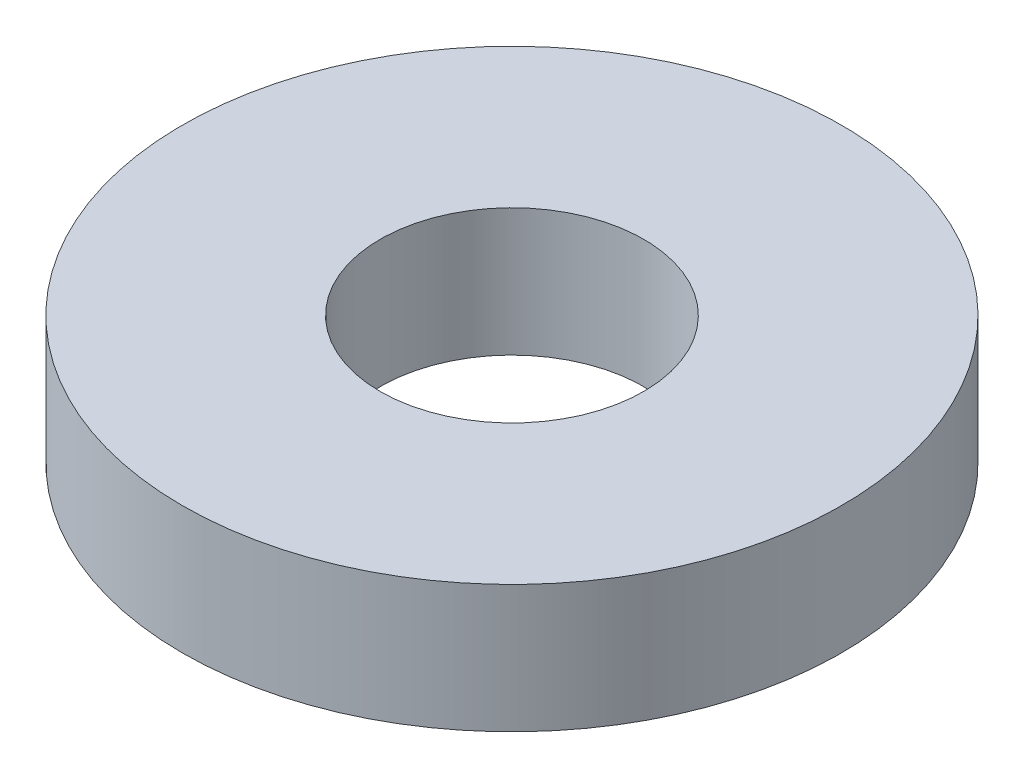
ISO-10303-21;
HEADER;
FILE_DESCRIPTION(('STEP AP214'),'2;1');
FILE_NAME('part.step','',(''),(''),'','','');
FILE_SCHEMA(('AUTOMOTIVE_DESIGN { 1 0 10303 214 1 1 1 1 }'));
ENDSEC;
DATA;
#1=APPLICATION_CONTEXT('core data for automotive mechanical design processes');
#2=APPLICATION_PROTOCOL_DEFINITION('international standard','automotive_design',2000,#1);
#3=PRODUCT_CONTEXT('',#1,'mechanical');
#4=PRODUCT('Part','Part','',(#3));
#5=PRODUCT_RELATED_PRODUCT_CATEGORY('part','',(#4));
#6=PRODUCT_DEFINITION_FORMATION('','',#4);
#7=PRODUCT_DEFINITION_CONTEXT('part definition',#1,'design');
#8=PRODUCT_DEFINITION('design','',#6,#7);
#9=PRODUCT_DEFINITION_SHAPE('','',#8);
#10=(LENGTH_UNIT() NAMED_UNIT(*) SI_UNIT(.MILLI.,.METRE.));
#11=(NAMED_UNIT(*) PLANE_ANGLE_UNIT() SI_UNIT($,.RADIAN.));
#12=(NAMED_UNIT(*) SI_UNIT($,.STERADIAN.) SOLID_ANGLE_UNIT());
#13=UNCERTAINTY_MEASURE_WITH_UNIT(LENGTH_MEASURE(1.E-05),#10,'distance_accuracy_value','');
#14=(GEOMETRIC_REPRESENTATION_CONTEXT(3) GLOBAL_UNCERTAINTY_ASSIGNED_CONTEXT((#13)) GLOBAL_UNIT_ASSIGNED_CONTEXT((#10,
#11,#12)) REPRESENTATION_CONTEXT('',''));
#15=CARTESIAN_POINT('',(0.,0.,0.));
#16=DIRECTION('',(0.,0.,1.));
#17=DIRECTION('',(1.,0.,0.));
#18=AXIS2_PLACEMENT_3D('',#15,#16,#17);
#19=CARTESIAN_POINT('',(0.,3.0734,0.));
#20=DIRECTION('',(0.,-1.,0.));
#21=DIRECTION('',(0.,0.,-1.));
#22=AXIS2_PLACEMENT_3D('',#19,#20,#21);
#23=CYLINDRICAL_SURFACE('',#22,7.9375);
#24=CARTESIAN_POINT('',(0.,3.0734,0.));
#25=DIRECTION('',(0.,1.,0.));
#26=DIRECTION('',(0.,0.,1.));
#27=AXIS2_PLACEMENT_3D('',#24,#25,#26);
#28=CIRCLE('',#27,7.9375);
#29=CARTESIAN_POINT('',(0.,3.0734,7.9375));
#30=VERTEX_POINT('',#29);
#31=EDGE_CURVE('E10',#30,#30,#28,.T.);
#32=ORIENTED_EDGE('',*,*,#31,.F.);
#33=EDGE_LOOP('',(#32));
#34=FACE_BOUND('',#33,.T.);
#35=CARTESIAN_POINT('',(0.,0.,0.));
#36=DIRECTION('',(0.,1.,0.));
#37=DIRECTION('',(0.,0.,1.));
#38=AXIS2_PLACEMENT_3D('',#35,#36,#37);
#39=CIRCLE('',#38,7.9375);
#40=CARTESIAN_POINT('',(0.,0.,7.9375));
#41=VERTEX_POINT('',#40);
#42=EDGE_CURVE('E34',#41,#41,#39,.T.);
#43=ORIENTED_EDGE('',*,*,#42,.T.);
#44=EDGE_LOOP('',(#43));
#45=FACE_BOUND('',#44,.T.);
#46=ADVANCED_FACE('F31',(#34,#45),#23,.T.);
#47=CARTESIAN_POINT('',(0.,3.0734,0.));
#48=DIRECTION('',(0.,1.,0.));
#49=DIRECTION('',(0.,0.,1.));
#50=AXIS2_PLACEMENT_3D('',#47,#48,#49);
#51=PLANE('',#50);
#52=CARTESIAN_POINT('',(0.,3.0734,0.));
#53=DIRECTION('',(0.,1.,0.));
#54=DIRECTION('',(0.,0.,1.));
#55=AXIS2_PLACEMENT_3D('',#52,#53,#54);
#56=CIRCLE('',#55,3.175);
#57=CARTESIAN_POINT('',(0.,3.0734,3.175));
#58=VERTEX_POINT('',#57);
#59=EDGE_CURVE('E43',#58,#58,#56,.T.);
#60=ORIENTED_EDGE('',*,*,#59,.F.);
#61=EDGE_LOOP('',(#60));
#62=FACE_BOUND('',#61,.T.);
#63=ORIENTED_EDGE('',*,*,#31,.T.);
#64=EDGE_LOOP('',(#63));
#65=FACE_BOUND('',#64,.T.);
#66=ADVANCED_FACE('F58',(#62,#65),#51,.T.);
#67=CARTESIAN_POINT('',(0.,0.,0.));
#68=DIRECTION('',(0.,1.,0.));
#69=DIRECTION('',(0.,0.,1.));
#70=AXIS2_PLACEMENT_3D('',#67,#68,#69);
#71=PLANE('',#70);
#72=CARTESIAN_POINT('',(0.,0.,0.));
#73=DIRECTION('',(0.,1.,0.));
#74=DIRECTION('',(0.,0.,1.));
#75=AXIS2_PLACEMENT_3D('',#72,#73,#74);
#76=CIRCLE('',#75,3.175);
#77=CARTESIAN_POINT('',(0.,0.,3.175));
#78=VERTEX_POINT('',#77);
#79=EDGE_CURVE('E41',#78,#78,#76,.T.);
#80=ORIENTED_EDGE('',*,*,#79,.T.);
#81=EDGE_LOOP('',(#80));
#82=FACE_BOUND('',#81,.T.);
#83=ORIENTED_EDGE('',*,*,#42,.F.);
#84=EDGE_LOOP('',(#83));
#85=FACE_BOUND('',#84,.T.);
#86=ADVANCED_FACE('F49',(#82,#85),#71,.F.);
#87=CARTESIAN_POINT('',(0.,0.,0.));
#88=DIRECTION('',(0.,1.,0.));
#89=DIRECTION('',(0.,0.,1.));
#90=AXIS2_PLACEMENT_3D('',#87,#88,#89);
#91=CYLINDRICAL_SURFACE('',#90,3.175);
#92=ORIENTED_EDGE('',*,*,#79,.F.);
#93=EDGE_LOOP('',(#92));
#94=FACE_BOUND('',#93,.T.);
#95=ORIENTED_EDGE('',*,*,#59,.T.);
#96=EDGE_LOOP('',(#95));
#97=FACE_BOUND('',#96,.T.);
#98=ADVANCED_FACE('F52',(#94,#97),#91,.F.);
#99=CLOSED_SHELL('',(#46,#66,#86,#98));
#100=MANIFOLD_SOLID_BREP('B2',#99);
#101=ADVANCED_BREP_SHAPE_REPRESENTATION('',(#18,#100),#14);
#102=SHAPE_DEFINITION_REPRESENTATION(#9,#101);
ENDSEC;
END-ISO-10303-21;
